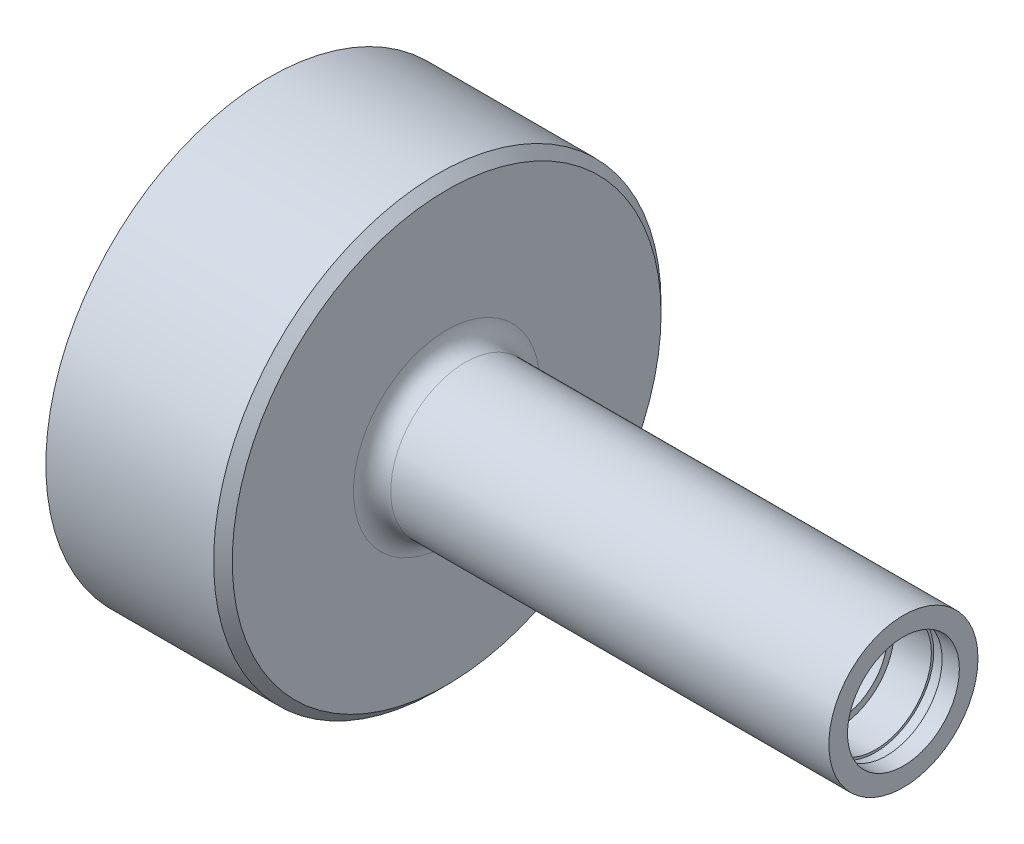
ISO-10303-21;
HEADER;
FILE_DESCRIPTION(('STEP AP214'),'2;1');
FILE_NAME('part.step','',(''),(''),'','','');
FILE_SCHEMA(('AUTOMOTIVE_DESIGN { 1 0 10303 214 1 1 1 1 }'));
ENDSEC;
DATA;
#1=APPLICATION_CONTEXT('core data for automotive mechanical design processes');
#2=APPLICATION_PROTOCOL_DEFINITION('international standard','automotive_design',2000,#1);
#3=PRODUCT_CONTEXT('',#1,'mechanical');
#4=PRODUCT('Part','Part','',(#3));
#5=PRODUCT_RELATED_PRODUCT_CATEGORY('part','',(#4));
#6=PRODUCT_DEFINITION_FORMATION('','',#4);
#7=PRODUCT_DEFINITION_CONTEXT('part definition',#1,'design');
#8=PRODUCT_DEFINITION('design','',#6,#7);
#9=PRODUCT_DEFINITION_SHAPE('','',#8);
#10=(LENGTH_UNIT() NAMED_UNIT(*) SI_UNIT(.MILLI.,.METRE.));
#11=(NAMED_UNIT(*) PLANE_ANGLE_UNIT() SI_UNIT($,.RADIAN.));
#12=(NAMED_UNIT(*) SI_UNIT($,.STERADIAN.) SOLID_ANGLE_UNIT());
#13=UNCERTAINTY_MEASURE_WITH_UNIT(LENGTH_MEASURE(1.E-05),#10,'distance_accuracy_value','');
#14=(GEOMETRIC_REPRESENTATION_CONTEXT(3) GLOBAL_UNCERTAINTY_ASSIGNED_CONTEXT((#13)) GLOBAL_UNIT_ASSIGNED_CONTEXT((#10,
#11,#12)) REPRESENTATION_CONTEXT('',''));
#15=CARTESIAN_POINT('',(0.,0.,0.));
#16=DIRECTION('',(0.,0.,1.));
#17=DIRECTION('',(1.,0.,0.));
#18=AXIS2_PLACEMENT_3D('',#15,#16,#17);
#19=CARTESIAN_POINT('',(0.,0.,0.));
#20=DIRECTION('',(1.,0.,0.));
#21=DIRECTION('',(0.,0.,-1.));
#22=AXIS2_PLACEMENT_3D('',#19,#20,#21);
#23=PLANE('',#22);
#24=CARTESIAN_POINT('',(0.,0.,-300.));
#25=DIRECTION('',(1.,0.,0.));
#26=DIRECTION('',(0.,0.,-1.));
#27=AXIS2_PLACEMENT_3D('',#24,#25,#26);
#28=CIRCLE('',#27,24.);
#29=CARTESIAN_POINT('',(0.,0.,-324.));
#30=VERTEX_POINT('',#29);
#31=EDGE_CURVE('E34',#30,#30,#28,.F.);
#32=ORIENTED_EDGE('',*,*,#31,.T.);
#33=EDGE_LOOP('',(#32));
#34=FACE_BOUND('',#33,.T.);
#35=CARTESIAN_POINT('',(0.,0.,-300.));
#36=DIRECTION('',(1.,0.,0.));
#37=DIRECTION('',(0.,0.,-1.));
#38=AXIS2_PLACEMENT_3D('',#35,#36,#37);
#39=CIRCLE('',#38,22.);
#40=CARTESIAN_POINT('',(0.,0.,-322.));
#41=VERTEX_POINT('',#40);
#42=EDGE_CURVE('E10',#41,#41,#39,.T.);
#43=ORIENTED_EDGE('',*,*,#42,.T.);
#44=EDGE_LOOP('',(#43));
#45=FACE_BOUND('',#44,.T.);
#46=ADVANCED_FACE('F31',(#34,#45),#23,.F.);
#47=CARTESIAN_POINT('',(-17.,0.,-300.));
#48=DIRECTION('',(-1.,0.,0.));
#49=DIRECTION('',(0.,0.,-1.));
#50=AXIS2_PLACEMENT_3D('',#47,#48,#49);
#51=CYLINDRICAL_SURFACE('',#50,24.);
#52=ORIENTED_EDGE('',*,*,#31,.F.);
#53=EDGE_LOOP('',(#52));
#54=FACE_BOUND('',#53,.T.);
#55=CARTESIAN_POINT('',(18.0000000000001,0.,-300.));
#56=DIRECTION('',(1.,0.,0.));
#57=DIRECTION('',(0.,0.,-1.));
#58=AXIS2_PLACEMENT_3D('',#55,#56,#57);
#59=CIRCLE('',#58,24.);
#60=CARTESIAN_POINT('',(18.0000000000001,0.,-324.));
#61=VERTEX_POINT('',#60);
#62=EDGE_CURVE('E48',#61,#61,#59,.F.);
#63=ORIENTED_EDGE('',*,*,#62,.T.);
#64=EDGE_LOOP('',(#63));
#65=FACE_BOUND('',#64,.T.);
#66=ADVANCED_FACE('F90',(#54,#65),#51,.T.);
#67=CARTESIAN_POINT('',(19.,0.,-300.));
#68=DIRECTION('',(-1.,0.,0.));
#69=DIRECTION('',(0.,0.,1.));
#70=AXIS2_PLACEMENT_3D('',#67,#68,#69);
#71=CYLINDRICAL_SURFACE('',#70,22.);
#72=ORIENTED_EDGE('',*,*,#42,.F.);
#73=EDGE_LOOP('',(#72));
#74=FACE_BOUND('',#73,.T.);
#75=CARTESIAN_POINT('',(17.,0.,-300.));
#76=DIRECTION('',(1.,0.,0.));
#77=DIRECTION('',(0.,0.,-1.));
#78=AXIS2_PLACEMENT_3D('',#75,#76,#77);
#79=CIRCLE('',#78,22.);
#80=CARTESIAN_POINT('',(17.,0.,-322.));
#81=VERTEX_POINT('',#80);
#82=EDGE_CURVE('E59',#81,#81,#79,.F.);
#83=ORIENTED_EDGE('',*,*,#82,.F.);
#84=EDGE_LOOP('',(#83));
#85=FACE_BOUND('',#84,.T.);
#86=ADVANCED_FACE('F88',(#74,#85),#71,.F.);
#87=CARTESIAN_POINT('',(17.,0.,-300.));
#88=DIRECTION('',(1.,0.,0.));
#89=DIRECTION('',(0.,0.,-1.));
#90=AXIS2_PLACEMENT_3D('',#87,#88,#89);
#91=PLANE('',#90);
#92=ORIENTED_EDGE('',*,*,#82,.T.);
#93=EDGE_LOOP('',(#92));
#94=FACE_BOUND('',#93,.T.);
#95=CARTESIAN_POINT('',(17.,0.,-300.));
#96=DIRECTION('',(1.,0.,0.));
#97=DIRECTION('',(0.,0.,-1.));
#98=AXIS2_PLACEMENT_3D('',#95,#96,#97);
#99=CIRCLE('',#98,5.30000000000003);
#100=CARTESIAN_POINT('',(17.,0.,-305.3));
#101=VERTEX_POINT('',#100);
#102=EDGE_CURVE('E58',#101,#101,#99,.T.);
#103=ORIENTED_EDGE('',*,*,#102,.T.);
#104=EDGE_LOOP('',(#103));
#105=FACE_BOUND('',#104,.T.);
#106=ADVANCED_FACE('F85',(#94,#105),#91,.F.);
#107=CARTESIAN_POINT('',(19.,0.,-300.));
#108=DIRECTION('',(1.,0.,0.));
#109=DIRECTION('',(0.,0.,-1.));
#110=AXIS2_PLACEMENT_3D('',#107,#108,#109);
#111=PLANE('',#110);
#112=CARTESIAN_POINT('',(19.,0.,-300.));
#113=DIRECTION('',(1.,0.,0.));
#114=DIRECTION('',(0.,0.,-1.));
#115=AXIS2_PLACEMENT_3D('',#112,#113,#114);
#116=CIRCLE('',#115,9.99999999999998);
#117=CARTESIAN_POINT('',(19.,0.,-310.));
#118=VERTEX_POINT('',#117);
#119=EDGE_CURVE('E41',#118,#118,#116,.F.);
#120=ORIENTED_EDGE('',*,*,#119,.T.);
#121=EDGE_LOOP('',(#120));
#122=FACE_BOUND('',#121,.T.);
#123=CARTESIAN_POINT('',(19.,0.,-300.));
#124=DIRECTION('',(1.,0.,0.));
#125=DIRECTION('',(0.,0.,-1.));
#126=AXIS2_PLACEMENT_3D('',#123,#124,#125);
#127=CIRCLE('',#126,23.0000000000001);
#128=CARTESIAN_POINT('',(19.,0.,-323.));
#129=VERTEX_POINT('',#128);
#130=EDGE_CURVE('E51',#129,#129,#127,.T.);
#131=ORIENTED_EDGE('',*,*,#130,.T.);
#132=EDGE_LOOP('',(#131));
#133=FACE_BOUND('',#132,.T.);
#134=ADVANCED_FACE('F97',(#122,#133),#111,.T.);
#135=CARTESIAN_POINT('',(-3.62741699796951,0.,-300.));
#136=DIRECTION('',(1.,0.,0.));
#137=DIRECTION('',(0.,0.,-1.));
#138=AXIS2_PLACEMENT_3D('',#135,#136,#137);
#139=CYLINDRICAL_SURFACE('',#138,7.99999999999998);
#140=CARTESIAN_POINT('',(21.,0.,-300.));
#141=DIRECTION('',(1.,0.,0.));
#142=DIRECTION('',(0.,0.,-1.));
#143=AXIS2_PLACEMENT_3D('',#140,#141,#142);
#144=CIRCLE('',#143,7.99999999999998);
#145=CARTESIAN_POINT('',(21.,0.,-308.));
#146=VERTEX_POINT('',#145);
#147=EDGE_CURVE('E45',#146,#146,#144,.T.);
#148=ORIENTED_EDGE('',*,*,#147,.T.);
#149=EDGE_LOOP('',(#148));
#150=FACE_BOUND('',#149,.T.);
#151=CARTESIAN_POINT('',(68.,0.,-300.));
#152=DIRECTION('',(1.,0.,0.));
#153=DIRECTION('',(0.,0.,-1.));
#154=AXIS2_PLACEMENT_3D('',#151,#152,#153);
#155=CIRCLE('',#154,7.99999999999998);
#156=CARTESIAN_POINT('',(68.,0.,-308.));
#157=VERTEX_POINT('',#156);
#158=EDGE_CURVE('E70',#157,#157,#155,.T.);
#159=ORIENTED_EDGE('',*,*,#158,.F.);
#160=EDGE_LOOP('',(#159));
#161=FACE_BOUND('',#160,.T.);
#162=ADVANCED_FACE('F120',(#150,#161),#139,.T.);
#163=CARTESIAN_POINT('',(68.,0.,-300.));
#164=DIRECTION('',(1.,0.,0.));
#165=DIRECTION('',(0.,0.,-1.));
#166=AXIS2_PLACEMENT_3D('',#163,#164,#165);
#167=PLANE('',#166);
#168=ORIENTED_EDGE('',*,*,#158,.T.);
#169=EDGE_LOOP('',(#168));
#170=FACE_BOUND('',#169,.T.);
#171=CARTESIAN_POINT('',(68.,0.,-300.));
#172=DIRECTION('',(1.,0.,0.));
#173=DIRECTION('',(0.,0.,-1.));
#174=AXIS2_PLACEMENT_3D('',#171,#172,#173);
#175=CIRCLE('',#174,5.99999999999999);
#176=CARTESIAN_POINT('',(68.,0.,-306.));
#177=VERTEX_POINT('',#176);
#178=EDGE_CURVE('E63',#177,#177,#175,.T.);
#179=ORIENTED_EDGE('',*,*,#178,.F.);
#180=EDGE_LOOP('',(#179));
#181=FACE_BOUND('',#180,.T.);
#182=ADVANCED_FACE('F125',(#170,#181),#167,.T.);
#183=CARTESIAN_POINT('',(61.,0.,-300.));
#184=DIRECTION('',(1.,0.,0.));
#185=DIRECTION('',(0.,0.,-1.));
#186=AXIS2_PLACEMENT_3D('',#183,#184,#185);
#187=CYLINDRICAL_SURFACE('',#186,6.);
#188=CARTESIAN_POINT('',(66.15,0.,-300.));
#189=DIRECTION('',(1.,0.,0.));
#190=DIRECTION('',(0.,0.,-1.));
#191=AXIS2_PLACEMENT_3D('',#188,#189,#190);
#192=CIRCLE('',#191,6.);
#193=CARTESIAN_POINT('',(66.15,0.,-306.));
#194=VERTEX_POINT('',#193);
#195=EDGE_CURVE('E60',#194,#194,#192,.T.);
#196=ORIENTED_EDGE('',*,*,#195,.F.);
#197=EDGE_LOOP('',(#196));
#198=FACE_BOUND('',#197,.T.);
#199=ORIENTED_EDGE('',*,*,#178,.T.);
#200=EDGE_LOOP('',(#199));
#201=FACE_BOUND('',#200,.T.);
#202=ADVANCED_FACE('F127',(#198,#201),#187,.F.);
#203=CARTESIAN_POINT('',(66.15,0.,-300.));
#204=DIRECTION('',(-1.,0.,0.));
#205=DIRECTION('',(0.,0.,1.));
#206=AXIS2_PLACEMENT_3D('',#203,#204,#205);
#207=CYLINDRICAL_SURFACE('',#206,6.25);
#208=CARTESIAN_POINT('',(66.15,0.,-300.));
#209=DIRECTION('',(1.,0.,0.));
#210=DIRECTION('',(0.,0.,-1.));
#211=AXIS2_PLACEMENT_3D('',#208,#209,#210);
#212=CIRCLE('',#211,6.25);
#213=CARTESIAN_POINT('',(66.15,0.,-306.25));
#214=VERTEX_POINT('',#213);
#215=EDGE_CURVE('E67',#214,#214,#212,.T.);
#216=ORIENTED_EDGE('',*,*,#215,.T.);
#217=EDGE_LOOP('',(#216));
#218=FACE_BOUND('',#217,.T.);
#219=CARTESIAN_POINT('',(65.,0.,-300.));
#220=DIRECTION('',(1.,0.,0.));
#221=DIRECTION('',(0.,0.,-1.));
#222=AXIS2_PLACEMENT_3D('',#219,#220,#221);
#223=CIRCLE('',#222,6.25);
#224=CARTESIAN_POINT('',(65.,0.,-306.25));
#225=VERTEX_POINT('',#224);
#226=EDGE_CURVE('E75',#225,#225,#223,.T.);
#227=ORIENTED_EDGE('',*,*,#226,.F.);
#228=EDGE_LOOP('',(#227));
#229=FACE_BOUND('',#228,.T.);
#230=ADVANCED_FACE('F130',(#218,#229),#207,.F.);
#231=CARTESIAN_POINT('',(66.15,0.,-300.));
#232=DIRECTION('',(1.,0.,0.));
#233=DIRECTION('',(0.,0.,-1.));
#234=AXIS2_PLACEMENT_3D('',#231,#232,#233);
#235=PLANE('',#234);
#236=ORIENTED_EDGE('',*,*,#195,.T.);
#237=EDGE_LOOP('',(#236));
#238=FACE_BOUND('',#237,.T.);
#239=ORIENTED_EDGE('',*,*,#215,.F.);
#240=EDGE_LOOP('',(#239));
#241=FACE_BOUND('',#240,.T.);
#242=ADVANCED_FACE('F143',(#238,#241),#235,.F.);
#243=CARTESIAN_POINT('',(65.,0.,-300.));
#244=DIRECTION('',(1.,0.,0.));
#245=DIRECTION('',(0.,0.,-1.));
#246=AXIS2_PLACEMENT_3D('',#243,#244,#245);
#247=PLANE('',#246);
#248=CARTESIAN_POINT('',(65.,0.,-300.));
#249=DIRECTION('',(1.,0.,0.));
#250=DIRECTION('',(0.,0.,-1.));
#251=AXIS2_PLACEMENT_3D('',#248,#249,#250);
#252=CIRCLE('',#251,6.);
#253=CARTESIAN_POINT('',(65.,0.,-306.));
#254=VERTEX_POINT('',#253);
#255=EDGE_CURVE('E64',#254,#254,#252,.T.);
#256=ORIENTED_EDGE('',*,*,#255,.F.);
#257=EDGE_LOOP('',(#256));
#258=FACE_BOUND('',#257,.T.);
#259=ORIENTED_EDGE('',*,*,#226,.T.);
#260=EDGE_LOOP('',(#259));
#261=FACE_BOUND('',#260,.T.);
#262=ADVANCED_FACE('F136',(#258,#261),#247,.T.);
#263=CARTESIAN_POINT('',(61.,0.,-300.));
#264=DIRECTION('',(-1.,0.,0.));
#265=DIRECTION('',(0.,0.,1.));
#266=AXIS2_PLACEMENT_3D('',#263,#264,#265);
#267=PLANE('',#266);
#268=CARTESIAN_POINT('',(61.,0.,-300.));
#269=DIRECTION('',(-1.,0.,0.));
#270=DIRECTION('',(0.,0.,1.));
#271=AXIS2_PLACEMENT_3D('',#268,#269,#270);
#272=CIRCLE('',#271,5.30000000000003);
#273=CARTESIAN_POINT('',(61.,0.,-294.7));
#274=VERTEX_POINT('',#273);
#275=EDGE_CURVE('E55',#274,#274,#272,.T.);
#276=ORIENTED_EDGE('',*,*,#275,.T.);
#277=EDGE_LOOP('',(#276));
#278=FACE_BOUND('',#277,.T.);
#279=CARTESIAN_POINT('',(61.,0.,-300.));
#280=DIRECTION('',(-1.,0.,0.));
#281=DIRECTION('',(0.,0.,1.));
#282=AXIS2_PLACEMENT_3D('',#279,#280,#281);
#283=CIRCLE('',#282,6.);
#284=CARTESIAN_POINT('',(61.,0.,-294.));
#285=VERTEX_POINT('',#284);
#286=EDGE_CURVE('E54',#285,#285,#283,.T.);
#287=ORIENTED_EDGE('',*,*,#286,.F.);
#288=EDGE_LOOP('',(#287));
#289=FACE_BOUND('',#288,.T.);
#290=ADVANCED_FACE('F133',(#278,#289),#267,.F.);
#291=ORIENTED_EDGE('',*,*,#286,.T.);
#292=EDGE_LOOP('',(#291));
#293=FACE_BOUND('',#292,.T.);
#294=ORIENTED_EDGE('',*,*,#255,.T.);
#295=EDGE_LOOP('',(#294));
#296=FACE_BOUND('',#295,.T.);
#297=ADVANCED_FACE('F132',(#293,#296),#187,.F.);
#298=CARTESIAN_POINT('',(-90.,0.,-300.));
#299=DIRECTION('',(1.,0.,0.));
#300=DIRECTION('',(0.,0.,-1.));
#301=AXIS2_PLACEMENT_3D('',#298,#299,#300);
#302=CYLINDRICAL_SURFACE('',#301,5.30000000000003);
#303=ORIENTED_EDGE('',*,*,#275,.F.);
#304=EDGE_LOOP('',(#303));
#305=FACE_BOUND('',#304,.T.);
#306=ORIENTED_EDGE('',*,*,#102,.F.);
#307=EDGE_LOOP('',(#306));
#308=FACE_BOUND('',#307,.T.);
#309=ADVANCED_FACE('F113',(#305,#308),#302,.F.);
#310=CARTESIAN_POINT('',(19.,0.,-300.));
#311=DIRECTION('',(-1.,0.,0.));
#312=DIRECTION('',(0.,0.,1.));
#313=AXIS2_PLACEMENT_3D('',#310,#311,#312);
#314=CONICAL_SURFACE('',#313,23.0000000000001,0.78539816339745);
#315=ORIENTED_EDGE('',*,*,#62,.F.);
#316=EDGE_LOOP('',(#315));
#317=FACE_BOUND('',#316,.T.);
#318=ORIENTED_EDGE('',*,*,#130,.F.);
#319=EDGE_LOOP('',(#318));
#320=FACE_BOUND('',#319,.T.);
#321=ADVANCED_FACE('F108',(#317,#320),#314,.T.);
#322=CARTESIAN_POINT('',(21.,0.,-300.));
#323=DIRECTION('',(1.,0.,0.));
#324=DIRECTION('',(0.,0.,-1.));
#325=AXIS2_PLACEMENT_3D('',#322,#323,#324);
#326=TOROIDAL_SURFACE('',#325,9.99999999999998,2.);
#327=ORIENTED_EDGE('',*,*,#119,.F.);
#328=EDGE_LOOP('',(#327));
#329=FACE_BOUND('',#328,.T.);
#330=ORIENTED_EDGE('',*,*,#147,.F.);
#331=EDGE_LOOP('',(#330));
#332=FACE_BOUND('',#331,.T.);
#333=ADVANCED_FACE('F104',(#329,#332),#326,.F.);
#334=CLOSED_SHELL('',(#46,#66,#86,#106,#134,#162,#182,#202,#230,#242,#262,#290,#297,#309,#321,#333));
#335=MANIFOLD_SOLID_BREP('B2',#334);
#336=ADVANCED_BREP_SHAPE_REPRESENTATION('',(#18,#335),#14);
#337=SHAPE_DEFINITION_REPRESENTATION(#9,#336);
ENDSEC;
END-ISO-10303-21;
